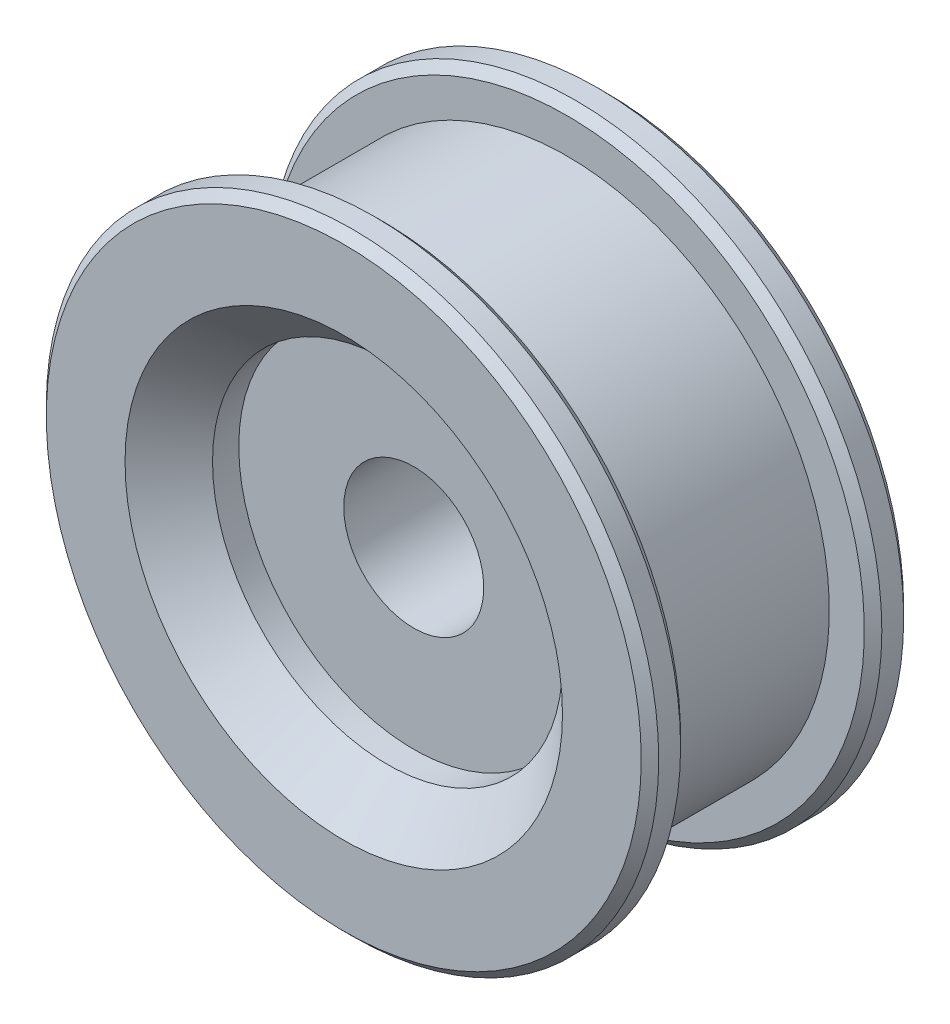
ISO-10303-21;
HEADER;
FILE_DESCRIPTION(('STEP AP214'),'2;1');
FILE_NAME('part.step','',(''),(''),'','','');
FILE_SCHEMA(('AUTOMOTIVE_DESIGN { 1 0 10303 214 1 1 1 1 }'));
ENDSEC;
DATA;
#1=APPLICATION_CONTEXT('core data for automotive mechanical design processes');
#2=APPLICATION_PROTOCOL_DEFINITION('international standard','automotive_design',2000,#1);
#3=PRODUCT_CONTEXT('',#1,'mechanical');
#4=PRODUCT('Part','Part','',(#3));
#5=PRODUCT_RELATED_PRODUCT_CATEGORY('part','',(#4));
#6=PRODUCT_DEFINITION_FORMATION('','',#4);
#7=PRODUCT_DEFINITION_CONTEXT('part definition',#1,'design');
#8=PRODUCT_DEFINITION('design','',#6,#7);
#9=PRODUCT_DEFINITION_SHAPE('','',#8);
#10=(LENGTH_UNIT() NAMED_UNIT(*) SI_UNIT(.MILLI.,.METRE.));
#11=(NAMED_UNIT(*) PLANE_ANGLE_UNIT() SI_UNIT($,.RADIAN.));
#12=(NAMED_UNIT(*) SI_UNIT($,.STERADIAN.) SOLID_ANGLE_UNIT());
#13=UNCERTAINTY_MEASURE_WITH_UNIT(LENGTH_MEASURE(1.E-05),#10,'distance_accuracy_value','');
#14=(GEOMETRIC_REPRESENTATION_CONTEXT(3) GLOBAL_UNCERTAINTY_ASSIGNED_CONTEXT((#13)) GLOBAL_UNIT_ASSIGNED_CONTEXT((#10,
#11,#12)) REPRESENTATION_CONTEXT('',''));
#15=CARTESIAN_POINT('',(0.,0.,0.));
#16=DIRECTION('',(0.,0.,1.));
#17=DIRECTION('',(1.,0.,0.));
#18=AXIS2_PLACEMENT_3D('',#15,#16,#17);
#19=CARTESIAN_POINT('',(0.,0.,7.5));
#20=DIRECTION('',(0.,0.,-1.));
#21=DIRECTION('',(-1.,0.,0.));
#22=AXIS2_PLACEMENT_3D('',#19,#20,#21);
#23=CYLINDRICAL_SURFACE('',#22,17.5);
#24=CARTESIAN_POINT('',(0.,0.,7.));
#25=DIRECTION('',(0.,0.,1.));
#26=DIRECTION('',(1.,0.,0.));
#27=AXIS2_PLACEMENT_3D('',#24,#25,#26);
#28=CIRCLE('',#27,17.5);
#29=CARTESIAN_POINT('',(17.5,0.,7.));
#30=VERTEX_POINT('',#29);
#31=EDGE_CURVE('E63',#30,#30,#28,.F.);
#32=ORIENTED_EDGE('',*,*,#31,.T.);
#33=EDGE_LOOP('',(#32));
#34=FACE_BOUND('',#33,.T.);
#35=CARTESIAN_POINT('',(0.,0.,5.75));
#36=DIRECTION('',(0.,0.,-1.));
#37=DIRECTION('',(-1.,0.,0.));
#38=AXIS2_PLACEMENT_3D('',#35,#36,#37);
#39=CIRCLE('',#38,17.5);
#40=CARTESIAN_POINT('',(-17.5,0.,5.75));
#41=VERTEX_POINT('',#40);
#42=EDGE_CURVE('E60',#41,#41,#39,.F.);
#43=ORIENTED_EDGE('',*,*,#42,.T.);
#44=EDGE_LOOP('',(#43));
#45=FACE_BOUND('',#44,.T.);
#46=ADVANCED_FACE('F12',(#34,#45),#23,.T.);
#47=CARTESIAN_POINT('',(0.,0.,7.5));
#48=DIRECTION('',(0.,0.,1.));
#49=DIRECTION('',(1.,0.,0.));
#50=AXIS2_PLACEMENT_3D('',#47,#48,#49);
#51=PLANE('',#50);
#52=CARTESIAN_POINT('',(0.,0.,7.5));
#53=DIRECTION('',(0.,0.,1.));
#54=DIRECTION('',(1.,0.,0.));
#55=AXIS2_PLACEMENT_3D('',#52,#53,#54);
#56=CIRCLE('',#55,12.5);
#57=CARTESIAN_POINT('',(12.5,0.,7.5));
#58=VERTEX_POINT('',#57);
#59=EDGE_CURVE('E35',#58,#58,#56,.T.);
#60=ORIENTED_EDGE('',*,*,#59,.F.);
#61=EDGE_LOOP('',(#60));
#62=FACE_BOUND('',#61,.T.);
#63=CARTESIAN_POINT('',(0.,0.,7.5));
#64=DIRECTION('',(0.,0.,1.));
#65=DIRECTION('',(1.,0.,0.));
#66=AXIS2_PLACEMENT_3D('',#63,#64,#65);
#67=CIRCLE('',#66,17.);
#68=CARTESIAN_POINT('',(17.,0.,7.5));
#69=VERTEX_POINT('',#68);
#70=EDGE_CURVE('E57',#69,#69,#67,.T.);
#71=ORIENTED_EDGE('',*,*,#70,.T.);
#72=EDGE_LOOP('',(#71));
#73=FACE_BOUND('',#72,.T.);
#74=ADVANCED_FACE('F104',(#62,#73),#51,.T.);
#75=CARTESIAN_POINT('',(0.,0.,5.25));
#76=DIRECTION('',(0.,0.,-1.));
#77=DIRECTION('',(-1.,0.,0.));
#78=AXIS2_PLACEMENT_3D('',#75,#76,#77);
#79=PLANE('',#78);
#80=CARTESIAN_POINT('',(0.,0.,5.25));
#81=DIRECTION('',(0.,0.,-1.));
#82=DIRECTION('',(-1.,0.,0.));
#83=AXIS2_PLACEMENT_3D('',#80,#81,#82);
#84=CIRCLE('',#83,17.);
#85=CARTESIAN_POINT('',(-17.,0.,5.25));
#86=VERTEX_POINT('',#85);
#87=EDGE_CURVE('E8',#86,#86,#84,.T.);
#88=ORIENTED_EDGE('',*,*,#87,.T.);
#89=EDGE_LOOP('',(#88));
#90=FACE_BOUND('',#89,.T.);
#91=CARTESIAN_POINT('',(0.,0.,5.25));
#92=DIRECTION('',(0.,0.,-1.));
#93=DIRECTION('',(-1.,0.,0.));
#94=AXIS2_PLACEMENT_3D('',#91,#92,#93);
#95=CIRCLE('',#94,15.);
#96=CARTESIAN_POINT('',(-15.,0.,5.25));
#97=VERTEX_POINT('',#96);
#98=EDGE_CURVE('E54',#97,#97,#95,.T.);
#99=ORIENTED_EDGE('',*,*,#98,.F.);
#100=EDGE_LOOP('',(#99));
#101=FACE_BOUND('',#100,.T.);
#102=ADVANCED_FACE('F110',(#90,#101),#79,.T.);
#103=CARTESIAN_POINT('',(0.,0.,-5.25));
#104=DIRECTION('',(0.,0.,-1.));
#105=DIRECTION('',(-1.,0.,0.));
#106=AXIS2_PLACEMENT_3D('',#103,#104,#105);
#107=PLANE('',#106);
#108=CARTESIAN_POINT('',(0.,0.,-5.25));
#109=DIRECTION('',(0.,0.,-1.));
#110=DIRECTION('',(-1.,0.,0.));
#111=AXIS2_PLACEMENT_3D('',#108,#109,#110);
#112=CIRCLE('',#111,17.);
#113=CARTESIAN_POINT('',(-17.,0.,-5.25));
#114=VERTEX_POINT('',#113);
#115=EDGE_CURVE('E25',#114,#114,#112,.F.);
#116=ORIENTED_EDGE('',*,*,#115,.T.);
#117=EDGE_LOOP('',(#116));
#118=FACE_BOUND('',#117,.T.);
#119=CARTESIAN_POINT('',(0.,0.,-5.25));
#120=DIRECTION('',(0.,0.,-1.));
#121=DIRECTION('',(-1.,0.,0.));
#122=AXIS2_PLACEMENT_3D('',#119,#120,#121);
#123=CIRCLE('',#122,15.);
#124=CARTESIAN_POINT('',(-15.,0.,-5.25));
#125=VERTEX_POINT('',#124);
#126=EDGE_CURVE('E51',#125,#125,#123,.T.);
#127=ORIENTED_EDGE('',*,*,#126,.T.);
#128=EDGE_LOOP('',(#127));
#129=FACE_BOUND('',#128,.T.);
#130=ADVANCED_FACE('F74',(#118,#129),#107,.F.);
#131=CARTESIAN_POINT('',(0.,0.,5.25));
#132=DIRECTION('',(0.,0.,-1.));
#133=DIRECTION('',(-1.,0.,0.));
#134=AXIS2_PLACEMENT_3D('',#131,#132,#133);
#135=CYLINDRICAL_SURFACE('',#134,15.);
#136=ORIENTED_EDGE('',*,*,#98,.T.);
#137=EDGE_LOOP('',(#136));
#138=FACE_BOUND('',#137,.T.);
#139=ORIENTED_EDGE('',*,*,#126,.F.);
#140=EDGE_LOOP('',(#139));
#141=FACE_BOUND('',#140,.T.);
#142=ADVANCED_FACE('F126',(#138,#141),#135,.T.);
#143=CARTESIAN_POINT('',(0.,0.,-7.5));
#144=DIRECTION('',(0.,0.,1.));
#145=DIRECTION('',(1.,0.,0.));
#146=AXIS2_PLACEMENT_3D('',#143,#144,#145);
#147=PLANE('',#146);
#148=CARTESIAN_POINT('',(0.,0.,-7.5));
#149=DIRECTION('',(0.,0.,-1.));
#150=DIRECTION('',(-1.,0.,0.));
#151=AXIS2_PLACEMENT_3D('',#148,#149,#150);
#152=CIRCLE('',#151,12.5);
#153=CARTESIAN_POINT('',(-12.5,0.,-7.5));
#154=VERTEX_POINT('',#153);
#155=EDGE_CURVE('E48',#154,#154,#152,.T.);
#156=ORIENTED_EDGE('',*,*,#155,.F.);
#157=EDGE_LOOP('',(#156));
#158=FACE_BOUND('',#157,.T.);
#159=CARTESIAN_POINT('',(0.,0.,-7.5));
#160=DIRECTION('',(0.,0.,1.));
#161=DIRECTION('',(1.,0.,0.));
#162=AXIS2_PLACEMENT_3D('',#159,#160,#161);
#163=CIRCLE('',#162,17.);
#164=CARTESIAN_POINT('',(17.,0.,-7.5));
#165=VERTEX_POINT('',#164);
#166=EDGE_CURVE('E20',#165,#165,#163,.F.);
#167=ORIENTED_EDGE('',*,*,#166,.T.);
#168=EDGE_LOOP('',(#167));
#169=FACE_BOUND('',#168,.T.);
#170=ADVANCED_FACE('F87',(#158,#169),#147,.F.);
#171=CARTESIAN_POINT('',(0.,0.,-5.75));
#172=DIRECTION('',(0.,0.,-1.));
#173=DIRECTION('',(-1.,0.,0.));
#174=AXIS2_PLACEMENT_3D('',#171,#172,#173);
#175=CIRCLE('',#174,17.5);
#176=CARTESIAN_POINT('',(-17.5,0.,-5.75));
#177=VERTEX_POINT('',#176);
#178=EDGE_CURVE('E69',#177,#177,#175,.T.);
#179=ORIENTED_EDGE('',*,*,#178,.T.);
#180=EDGE_LOOP('',(#179));
#181=FACE_BOUND('',#180,.T.);
#182=CARTESIAN_POINT('',(0.,0.,-7.));
#183=DIRECTION('',(0.,0.,1.));
#184=DIRECTION('',(1.,0.,0.));
#185=AXIS2_PLACEMENT_3D('',#182,#183,#184);
#186=CIRCLE('',#185,17.5);
#187=CARTESIAN_POINT('',(17.5,0.,-7.));
#188=VERTEX_POINT('',#187);
#189=EDGE_CURVE('E66',#188,#188,#186,.T.);
#190=ORIENTED_EDGE('',*,*,#189,.T.);
#191=EDGE_LOOP('',(#190));
#192=FACE_BOUND('',#191,.T.);
#193=ADVANCED_FACE('F14',(#181,#192),#23,.T.);
#194=CARTESIAN_POINT('',(0.,0.,7.5));
#195=DIRECTION('',(0.,0.,-1.));
#196=DIRECTION('',(-1.,0.,0.));
#197=AXIS2_PLACEMENT_3D('',#194,#195,#196);
#198=CONICAL_SURFACE('',#197,17.,0.785398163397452);
#199=ORIENTED_EDGE('',*,*,#31,.F.);
#200=EDGE_LOOP('',(#199));
#201=FACE_BOUND('',#200,.T.);
#202=ORIENTED_EDGE('',*,*,#70,.F.);
#203=EDGE_LOOP('',(#202));
#204=FACE_BOUND('',#203,.T.);
#205=ADVANCED_FACE('F81',(#201,#204),#198,.T.);
#206=CARTESIAN_POINT('',(0.,0.,-5.75));
#207=DIRECTION('',(0.,0.,-1.));
#208=DIRECTION('',(-1.,0.,0.));
#209=AXIS2_PLACEMENT_3D('',#206,#207,#208);
#210=CONICAL_SURFACE('',#209,17.5,0.785398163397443);
#211=ORIENTED_EDGE('',*,*,#115,.F.);
#212=EDGE_LOOP('',(#211));
#213=FACE_BOUND('',#212,.T.);
#214=ORIENTED_EDGE('',*,*,#178,.F.);
#215=EDGE_LOOP('',(#214));
#216=FACE_BOUND('',#215,.T.);
#217=ADVANCED_FACE('F77',(#213,#216),#210,.T.);
#218=CARTESIAN_POINT('',(0.,0.,-7.));
#219=DIRECTION('',(0.,0.,1.));
#220=DIRECTION('',(1.,0.,0.));
#221=AXIS2_PLACEMENT_3D('',#218,#219,#220);
#222=CONICAL_SURFACE('',#221,17.5,0.785398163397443);
#223=ORIENTED_EDGE('',*,*,#166,.F.);
#224=EDGE_LOOP('',(#223));
#225=FACE_BOUND('',#224,.T.);
#226=ORIENTED_EDGE('',*,*,#189,.F.);
#227=EDGE_LOOP('',(#226));
#228=FACE_BOUND('',#227,.T.);
#229=ADVANCED_FACE('F80',(#225,#228),#222,.T.);
#230=CARTESIAN_POINT('',(0.,0.,5.25));
#231=DIRECTION('',(0.,0.,1.));
#232=DIRECTION('',(1.,0.,0.));
#233=AXIS2_PLACEMENT_3D('',#230,#231,#232);
#234=CONICAL_SURFACE('',#233,17.,0.785398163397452);
#235=ORIENTED_EDGE('',*,*,#42,.F.);
#236=EDGE_LOOP('',(#235));
#237=FACE_BOUND('',#236,.T.);
#238=ORIENTED_EDGE('',*,*,#87,.F.);
#239=EDGE_LOOP('',(#238));
#240=FACE_BOUND('',#239,.T.);
#241=ADVANCED_FACE('F91',(#237,#240),#234,.T.);
#242=CARTESIAN_POINT('',(0.,0.,-7.5));
#243=DIRECTION('',(0.,0.,-1.));
#244=DIRECTION('',(-1.,0.,0.));
#245=AXIS2_PLACEMENT_3D('',#242,#243,#244);
#246=CONICAL_SURFACE('',#245,12.5,0.78539816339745);
#247=CARTESIAN_POINT('',(0.,0.,-5.));
#248=DIRECTION('',(0.,0.,-1.));
#249=DIRECTION('',(-1.,0.,0.));
#250=AXIS2_PLACEMENT_3D('',#247,#248,#249);
#251=CIRCLE('',#250,10.);
#252=CARTESIAN_POINT('',(-10.,0.,-5.));
#253=VERTEX_POINT('',#252);
#254=EDGE_CURVE('E30',#253,#253,#251,.T.);
#255=ORIENTED_EDGE('',*,*,#254,.F.);
#256=EDGE_LOOP('',(#255));
#257=FACE_BOUND('',#256,.T.);
#258=ORIENTED_EDGE('',*,*,#155,.T.);
#259=EDGE_LOOP('',(#258));
#260=FACE_BOUND('',#259,.T.);
#261=ADVANCED_FACE('F99',(#257,#260),#246,.F.);
#262=CARTESIAN_POINT('',(0.,0.,7.5));
#263=DIRECTION('',(0.,0.,1.));
#264=DIRECTION('',(1.,0.,0.));
#265=AXIS2_PLACEMENT_3D('',#262,#263,#264);
#266=CONICAL_SURFACE('',#265,12.5,0.78539816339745);
#267=CARTESIAN_POINT('',(0.,0.,5.));
#268=DIRECTION('',(0.,0.,1.));
#269=DIRECTION('',(1.,0.,0.));
#270=AXIS2_PLACEMENT_3D('',#267,#268,#269);
#271=CIRCLE('',#270,10.);
#272=CARTESIAN_POINT('',(10.,0.,5.));
#273=VERTEX_POINT('',#272);
#274=EDGE_CURVE('E38',#273,#273,#271,.T.);
#275=ORIENTED_EDGE('',*,*,#274,.F.);
#276=EDGE_LOOP('',(#275));
#277=FACE_BOUND('',#276,.T.);
#278=ORIENTED_EDGE('',*,*,#59,.T.);
#279=EDGE_LOOP('',(#278));
#280=FACE_BOUND('',#279,.T.);
#281=ADVANCED_FACE('F143',(#277,#280),#266,.F.);
#282=CARTESIAN_POINT('',(0.,0.,7.5));
#283=DIRECTION('',(0.,0.,-1.));
#284=DIRECTION('',(-1.,0.,0.));
#285=AXIS2_PLACEMENT_3D('',#282,#283,#284);
#286=CYLINDRICAL_SURFACE('',#285,4.);
#287=CARTESIAN_POINT('',(0.,0.,3.5));
#288=DIRECTION('',(0.,0.,-1.));
#289=DIRECTION('',(-1.,0.,0.));
#290=AXIS2_PLACEMENT_3D('',#287,#288,#289);
#291=CIRCLE('',#290,4.);
#292=CARTESIAN_POINT('',(-4.,0.,3.5));
#293=VERTEX_POINT('',#292);
#294=EDGE_CURVE('E16',#293,#293,#291,.F.);
#295=ORIENTED_EDGE('',*,*,#294,.T.);
#296=EDGE_LOOP('',(#295));
#297=FACE_BOUND('',#296,.T.);
#298=CARTESIAN_POINT('',(0.,0.,-3.5));
#299=DIRECTION('',(0.,0.,1.));
#300=DIRECTION('',(1.,0.,0.));
#301=AXIS2_PLACEMENT_3D('',#298,#299,#300);
#302=CIRCLE('',#301,4.);
#303=CARTESIAN_POINT('',(4.,0.,-3.5));
#304=VERTEX_POINT('',#303);
#305=EDGE_CURVE('E28',#304,#304,#302,.F.);
#306=ORIENTED_EDGE('',*,*,#305,.T.);
#307=EDGE_LOOP('',(#306));
#308=FACE_BOUND('',#307,.T.);
#309=ADVANCED_FACE('F150',(#297,#308),#286,.F.);
#310=CARTESIAN_POINT('',(0.,0.,-3.5));
#311=DIRECTION('',(0.,0.,1.));
#312=DIRECTION('',(1.,0.,0.));
#313=AXIS2_PLACEMENT_3D('',#310,#311,#312);
#314=PLANE('',#313);
#315=CARTESIAN_POINT('',(0.,0.,-3.5));
#316=DIRECTION('',(0.,0.,-1.));
#317=DIRECTION('',(-1.,0.,0.));
#318=AXIS2_PLACEMENT_3D('',#315,#316,#317);
#319=CIRCLE('',#318,10.);
#320=CARTESIAN_POINT('',(-10.,0.,-3.5));
#321=VERTEX_POINT('',#320);
#322=EDGE_CURVE('E31',#321,#321,#319,.T.);
#323=ORIENTED_EDGE('',*,*,#322,.T.);
#324=EDGE_LOOP('',(#323));
#325=FACE_BOUND('',#324,.T.);
#326=ORIENTED_EDGE('',*,*,#305,.F.);
#327=EDGE_LOOP('',(#326));
#328=FACE_BOUND('',#327,.T.);
#329=ADVANCED_FACE('F157',(#325,#328),#314,.F.);
#330=CARTESIAN_POINT('',(0.,0.,-7.5));
#331=DIRECTION('',(0.,0.,-1.));
#332=DIRECTION('',(-1.,0.,0.));
#333=AXIS2_PLACEMENT_3D('',#330,#331,#332);
#334=CYLINDRICAL_SURFACE('',#333,10.);
#335=ORIENTED_EDGE('',*,*,#254,.T.);
#336=EDGE_LOOP('',(#335));
#337=FACE_BOUND('',#336,.T.);
#338=ORIENTED_EDGE('',*,*,#322,.F.);
#339=EDGE_LOOP('',(#338));
#340=FACE_BOUND('',#339,.T.);
#341=ADVANCED_FACE('F161',(#337,#340),#334,.F.);
#342=CARTESIAN_POINT('',(0.,0.,3.5));
#343=DIRECTION('',(0.,0.,-1.));
#344=DIRECTION('',(-1.,0.,0.));
#345=AXIS2_PLACEMENT_3D('',#342,#343,#344);
#346=PLANE('',#345);
#347=CARTESIAN_POINT('',(0.,0.,3.5));
#348=DIRECTION('',(0.,0.,-1.));
#349=DIRECTION('',(-1.,0.,0.));
#350=AXIS2_PLACEMENT_3D('',#347,#348,#349);
#351=CIRCLE('',#350,10.);
#352=CARTESIAN_POINT('',(-10.,0.,3.5));
#353=VERTEX_POINT('',#352);
#354=EDGE_CURVE('E178',#353,#353,#351,.T.);
#355=ORIENTED_EDGE('',*,*,#354,.F.);
#356=EDGE_LOOP('',(#355));
#357=FACE_BOUND('',#356,.T.);
#358=ORIENTED_EDGE('',*,*,#294,.F.);
#359=EDGE_LOOP('',(#358));
#360=FACE_BOUND('',#359,.T.);
#361=ADVANCED_FACE('F164',(#357,#360),#346,.F.);
#362=CARTESIAN_POINT('',(0.,0.,-7.5));
#363=DIRECTION('',(0.,0.,-1.));
#364=DIRECTION('',(-1.,0.,0.));
#365=AXIS2_PLACEMENT_3D('',#362,#363,#364);
#366=CYLINDRICAL_SURFACE('',#365,10.);
#367=ORIENTED_EDGE('',*,*,#274,.T.);
#368=EDGE_LOOP('',(#367));
#369=FACE_BOUND('',#368,.T.);
#370=ORIENTED_EDGE('',*,*,#354,.T.);
#371=EDGE_LOOP('',(#370));
#372=FACE_BOUND('',#371,.T.);
#373=ADVANCED_FACE('F166',(#369,#372),#366,.F.);
#374=CLOSED_SHELL('',(#46,#74,#102,#130,#142,#170,#193,#205,#217,#229,#241,#261,#281,#309,#329,
#341,#361,#373));
#375=MANIFOLD_SOLID_BREP('B1',#374);
#376=ADVANCED_BREP_SHAPE_REPRESENTATION('',(#18,#375),#14);
#377=SHAPE_DEFINITION_REPRESENTATION(#9,#376);
ENDSEC;
END-ISO-10303-21;
